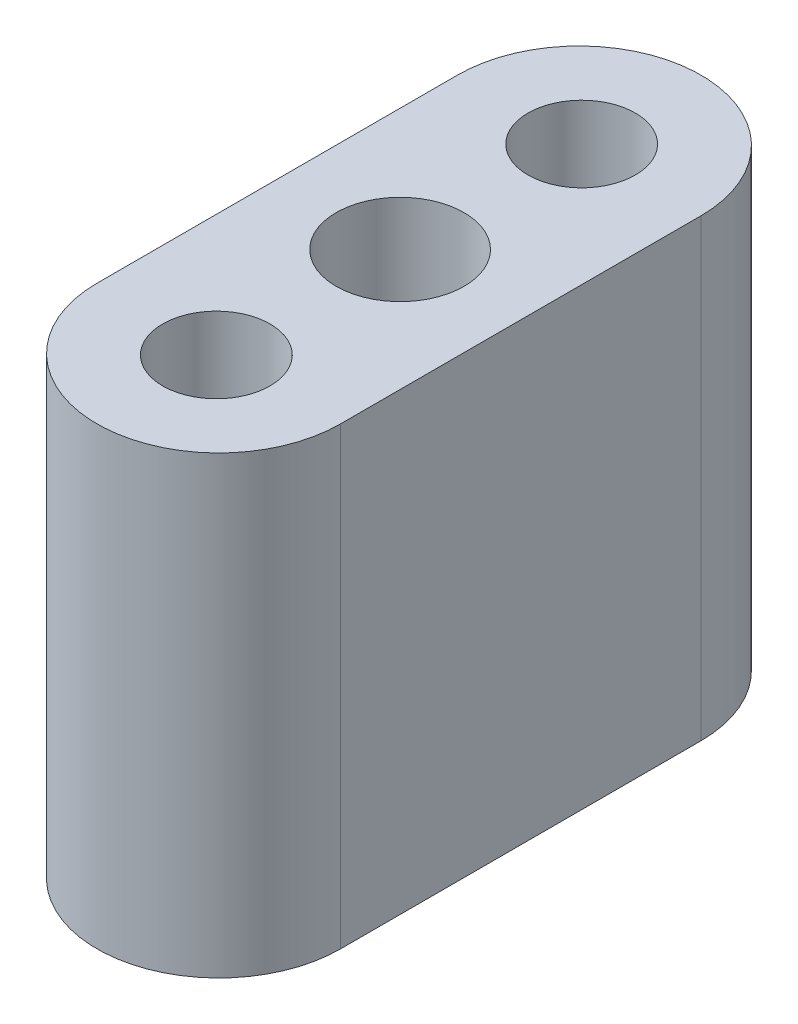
ISO-10303-21;
HEADER;
FILE_DESCRIPTION(('STEP AP214'),'2;1');
FILE_NAME('part.step','',(''),(''),'','','');
FILE_SCHEMA(('AUTOMOTIVE_DESIGN { 1 0 10303 214 1 1 1 1 }'));
ENDSEC;
DATA;
#1=APPLICATION_CONTEXT('core data for automotive mechanical design processes');
#2=APPLICATION_PROTOCOL_DEFINITION('international standard','automotive_design',2000,#1);
#3=PRODUCT_CONTEXT('',#1,'mechanical');
#4=PRODUCT('Part','Part','',(#3));
#5=PRODUCT_RELATED_PRODUCT_CATEGORY('part','',(#4));
#6=PRODUCT_DEFINITION_FORMATION('','',#4);
#7=PRODUCT_DEFINITION_CONTEXT('part definition',#1,'design');
#8=PRODUCT_DEFINITION('design','',#6,#7);
#9=PRODUCT_DEFINITION_SHAPE('','',#8);
#10=(LENGTH_UNIT() NAMED_UNIT(*) SI_UNIT(.MILLI.,.METRE.));
#11=(NAMED_UNIT(*) PLANE_ANGLE_UNIT() SI_UNIT($,.RADIAN.));
#12=(NAMED_UNIT(*) SI_UNIT($,.STERADIAN.) SOLID_ANGLE_UNIT());
#13=UNCERTAINTY_MEASURE_WITH_UNIT(LENGTH_MEASURE(1.E-05),#10,'distance_accuracy_value','');
#14=(GEOMETRIC_REPRESENTATION_CONTEXT(3) GLOBAL_UNCERTAINTY_ASSIGNED_CONTEXT((#13)) GLOBAL_UNIT_ASSIGNED_CONTEXT((#10,
#11,#12)) REPRESENTATION_CONTEXT('',''));
#15=CARTESIAN_POINT('',(0.,0.,0.));
#16=DIRECTION('',(0.,0.,1.));
#17=DIRECTION('',(1.,0.,0.));
#18=AXIS2_PLACEMENT_3D('',#15,#16,#17);
#19=CARTESIAN_POINT('',(0.,17.78,-7.0485));
#20=DIRECTION('',(0.,-1.,0.));
#21=DIRECTION('',(0.,0.,-1.));
#22=AXIS2_PLACEMENT_3D('',#19,#20,#21);
#23=CYLINDRICAL_SURFACE('',#22,4.7625);
#24=CARTESIAN_POINT('',(0.,0.,-7.0485));
#25=DIRECTION('',(0.,1.,0.));
#26=DIRECTION('',(0.,0.,1.));
#27=AXIS2_PLACEMENT_3D('',#24,#25,#26);
#28=CIRCLE('',#27,4.7625);
#29=CARTESIAN_POINT('',(4.7625,0.,-7.0485));
#30=VERTEX_POINT('',#29);
#31=CARTESIAN_POINT('',(-4.7625,0.,-7.0485));
#32=VERTEX_POINT('',#31);
#33=EDGE_CURVE('E121',#30,#32,#28,.T.);
#34=ORIENTED_EDGE('',*,*,#33,.T.);
#35=DIRECTION('',(0.,-1.,0.));
#36=VECTOR('',#35,1.);
#37=CARTESIAN_POINT('',(-4.7625,17.78,-7.0485));
#38=LINE('',#37,#36);
#39=CARTESIAN_POINT('',(-4.7625,17.78,-7.0485));
#40=VERTEX_POINT('',#39);
#41=EDGE_CURVE('E11',#40,#32,#38,.T.);
#42=ORIENTED_EDGE('',*,*,#41,.F.);
#43=CARTESIAN_POINT('',(0.,17.78,-7.0485));
#44=DIRECTION('',(0.,1.,0.));
#45=DIRECTION('',(0.,0.,1.));
#46=AXIS2_PLACEMENT_3D('',#43,#44,#45);
#47=CIRCLE('',#46,4.7625);
#48=CARTESIAN_POINT('',(4.7625,17.78,-7.0485));
#49=VERTEX_POINT('',#48);
#50=EDGE_CURVE('E122',#49,#40,#47,.T.);
#51=ORIENTED_EDGE('',*,*,#50,.F.);
#52=DIRECTION('',(0.,-1.,0.));
#53=VECTOR('',#52,1.);
#54=CARTESIAN_POINT('',(4.7625,17.78,-7.0485));
#55=LINE('',#54,#53);
#56=EDGE_CURVE('E128',#49,#30,#55,.T.);
#57=ORIENTED_EDGE('',*,*,#56,.T.);
#58=EDGE_LOOP('',(#34,#42,#51,#57));
#59=FACE_BOUND('',#58,.T.);
#60=ADVANCED_FACE('F37',(#59),#23,.T.);
#61=CARTESIAN_POINT('',(-4.7625,17.78,-7.0485));
#62=DIRECTION('',(1.,0.,0.));
#63=DIRECTION('',(0.,0.,-1.));
#64=AXIS2_PLACEMENT_3D('',#61,#62,#63);
#65=PLANE('',#64);
#66=DIRECTION('',(0.,0.,1.));
#67=VECTOR('',#66,1.);
#68=CARTESIAN_POINT('',(-4.7625,0.,-7.0485));
#69=LINE('',#68,#67);
#70=CARTESIAN_POINT('',(-4.7625,0.,7.0485));
#71=VERTEX_POINT('',#70);
#72=EDGE_CURVE('E131',#32,#71,#69,.T.);
#73=ORIENTED_EDGE('',*,*,#72,.T.);
#74=DIRECTION('',(0.,-1.,0.));
#75=VECTOR('',#74,1.);
#76=CARTESIAN_POINT('',(-4.7625,17.78,7.0485));
#77=LINE('',#76,#75);
#78=CARTESIAN_POINT('',(-4.7625,17.78,7.0485));
#79=VERTEX_POINT('',#78);
#80=EDGE_CURVE('E45',#79,#71,#77,.T.);
#81=ORIENTED_EDGE('',*,*,#80,.F.);
#82=DIRECTION('',(0.,0.,1.));
#83=VECTOR('',#82,1.);
#84=CARTESIAN_POINT('',(-4.7625,17.78,-7.0485));
#85=LINE('',#84,#83);
#86=EDGE_CURVE('E84',#40,#79,#85,.T.);
#87=ORIENTED_EDGE('',*,*,#86,.F.);
#88=ORIENTED_EDGE('',*,*,#41,.T.);
#89=EDGE_LOOP('',(#73,#81,#87,#88));
#90=FACE_BOUND('',#89,.T.);
#91=ADVANCED_FACE('F155',(#90),#65,.F.);
#92=CARTESIAN_POINT('',(0.,17.78,7.0485));
#93=DIRECTION('',(0.,-1.,0.));
#94=DIRECTION('',(0.,0.,-1.));
#95=AXIS2_PLACEMENT_3D('',#92,#93,#94);
#96=CYLINDRICAL_SURFACE('',#95,4.7625);
#97=CARTESIAN_POINT('',(0.,0.,7.0485));
#98=DIRECTION('',(0.,1.,0.));
#99=DIRECTION('',(0.,0.,1.));
#100=AXIS2_PLACEMENT_3D('',#97,#98,#99);
#101=CIRCLE('',#100,4.7625);
#102=CARTESIAN_POINT('',(4.7625,0.,7.0485));
#103=VERTEX_POINT('',#102);
#104=EDGE_CURVE('E71',#71,#103,#101,.T.);
#105=ORIENTED_EDGE('',*,*,#104,.T.);
#106=DIRECTION('',(0.,-1.,0.));
#107=VECTOR('',#106,1.);
#108=CARTESIAN_POINT('',(4.7625,17.78,7.0485));
#109=LINE('',#108,#107);
#110=CARTESIAN_POINT('',(4.7625,17.78,7.0485));
#111=VERTEX_POINT('',#110);
#112=EDGE_CURVE('E136',#111,#103,#109,.T.);
#113=ORIENTED_EDGE('',*,*,#112,.F.);
#114=CARTESIAN_POINT('',(0.,17.78,7.0485));
#115=DIRECTION('',(0.,1.,0.));
#116=DIRECTION('',(0.,0.,1.));
#117=AXIS2_PLACEMENT_3D('',#114,#115,#116);
#118=CIRCLE('',#117,4.7625);
#119=EDGE_CURVE('E125',#79,#111,#118,.T.);
#120=ORIENTED_EDGE('',*,*,#119,.F.);
#121=ORIENTED_EDGE('',*,*,#80,.T.);
#122=EDGE_LOOP('',(#105,#113,#120,#121));
#123=FACE_BOUND('',#122,.T.);
#124=ADVANCED_FACE('F138',(#123),#96,.T.);
#125=CARTESIAN_POINT('',(4.7625,17.78,7.0485));
#126=DIRECTION('',(-1.,0.,0.));
#127=DIRECTION('',(0.,0.,1.));
#128=AXIS2_PLACEMENT_3D('',#125,#126,#127);
#129=PLANE('',#128);
#130=DIRECTION('',(0.,0.,-1.));
#131=VECTOR('',#130,1.);
#132=CARTESIAN_POINT('',(4.7625,0.,7.0485));
#133=LINE('',#132,#131);
#134=EDGE_CURVE('E77',#103,#30,#133,.T.);
#135=ORIENTED_EDGE('',*,*,#134,.T.);
#136=ORIENTED_EDGE('',*,*,#56,.F.);
#137=DIRECTION('',(0.,0.,-1.));
#138=VECTOR('',#137,1.);
#139=CARTESIAN_POINT('',(4.7625,17.78,7.0485));
#140=LINE('',#139,#138);
#141=EDGE_CURVE('E53',#111,#49,#140,.T.);
#142=ORIENTED_EDGE('',*,*,#141,.F.);
#143=ORIENTED_EDGE('',*,*,#112,.T.);
#144=EDGE_LOOP('',(#135,#136,#142,#143));
#145=FACE_BOUND('',#144,.T.);
#146=ADVANCED_FACE('F145',(#145),#129,.F.);
#147=CARTESIAN_POINT('',(0.,17.78,-7.0485));
#148=DIRECTION('',(0.,1.,0.));
#149=DIRECTION('',(0.,0.,1.));
#150=AXIS2_PLACEMENT_3D('',#147,#148,#149);
#151=PLANE('',#150);
#152=CARTESIAN_POINT('',(0.,17.78,-7.14248));
#153=DIRECTION('',(0.,1.,0.));
#154=DIRECTION('',(0.,0.,1.));
#155=AXIS2_PLACEMENT_3D('',#152,#153,#154);
#156=CIRCLE('',#155,2.09999999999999);
#157=CARTESIAN_POINT('',(0.,17.78,-5.04248000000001));
#158=VERTEX_POINT('',#157);
#159=EDGE_CURVE('E105',#158,#158,#156,.T.);
#160=ORIENTED_EDGE('',*,*,#159,.F.);
#161=EDGE_LOOP('',(#160));
#162=FACE_BOUND('',#161,.T.);
#163=CARTESIAN_POINT('',(0.,17.78,7.14248));
#164=DIRECTION('',(0.,1.,0.));
#165=DIRECTION('',(0.,0.,1.));
#166=AXIS2_PLACEMENT_3D('',#163,#164,#165);
#167=CIRCLE('',#166,2.09999999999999);
#168=CARTESIAN_POINT('',(0.,17.78,9.24247999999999));
#169=VERTEX_POINT('',#168);
#170=EDGE_CURVE('E104',#169,#169,#167,.T.);
#171=ORIENTED_EDGE('',*,*,#170,.F.);
#172=EDGE_LOOP('',(#171));
#173=FACE_BOUND('',#172,.T.);
#174=CARTESIAN_POINT('',(0.021671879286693,17.78,-0.0216718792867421));
#175=DIRECTION('',(0.,1.,0.));
#176=DIRECTION('',(0.,0.,1.));
#177=AXIS2_PLACEMENT_3D('',#174,#175,#176);
#178=CIRCLE('',#177,2.5);
#179=CARTESIAN_POINT('',(0.021671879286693,17.78,2.47832812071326));
#180=VERTEX_POINT('',#179);
#181=EDGE_CURVE('E118',#180,#180,#178,.T.);
#182=ORIENTED_EDGE('',*,*,#181,.F.);
#183=EDGE_LOOP('',(#182));
#184=FACE_BOUND('',#183,.T.);
#185=ORIENTED_EDGE('',*,*,#50,.T.);
#186=ORIENTED_EDGE('',*,*,#86,.T.);
#187=ORIENTED_EDGE('',*,*,#119,.T.);
#188=ORIENTED_EDGE('',*,*,#141,.T.);
#189=EDGE_LOOP('',(#185,#186,#187,#188));
#190=FACE_BOUND('',#189,.T.);
#191=ADVANCED_FACE('F147',(#162,#173,#184,#190),#151,.T.);
#192=CARTESIAN_POINT('',(0.,0.,-7.0485));
#193=DIRECTION('',(0.,1.,0.));
#194=DIRECTION('',(0.,0.,1.));
#195=AXIS2_PLACEMENT_3D('',#192,#193,#194);
#196=PLANE('',#195);
#197=ORIENTED_EDGE('',*,*,#33,.F.);
#198=ORIENTED_EDGE('',*,*,#134,.F.);
#199=ORIENTED_EDGE('',*,*,#104,.F.);
#200=ORIENTED_EDGE('',*,*,#72,.F.);
#201=EDGE_LOOP('',(#197,#198,#199,#200));
#202=FACE_BOUND('',#201,.T.);
#203=ADVANCED_FACE('F141',(#202),#196,.F.);
#204=CARTESIAN_POINT('',(0.021671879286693,17.78,-0.0216718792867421));
#205=DIRECTION('',(0.,1.,0.));
#206=DIRECTION('',(0.,0.,1.));
#207=AXIS2_PLACEMENT_3D('',#204,#205,#206);
#208=CYLINDRICAL_SURFACE('',#207,2.5);
#209=CARTESIAN_POINT('',(0.021671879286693,11.7856,-0.0216718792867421));
#210=DIRECTION('',(0.,1.,0.));
#211=DIRECTION('',(0.,0.,1.));
#212=AXIS2_PLACEMENT_3D('',#209,#210,#211);
#213=CIRCLE('',#212,2.5);
#214=CARTESIAN_POINT('',(0.021671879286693,11.7856,2.47832812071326));
#215=VERTEX_POINT('',#214);
#216=EDGE_CURVE('E115',#215,#215,#213,.T.);
#217=ORIENTED_EDGE('',*,*,#216,.F.);
#218=EDGE_LOOP('',(#217));
#219=FACE_BOUND('',#218,.T.);
#220=ORIENTED_EDGE('',*,*,#181,.T.);
#221=EDGE_LOOP('',(#220));
#222=FACE_BOUND('',#221,.T.);
#223=ADVANCED_FACE('F182',(#219,#222),#208,.F.);
#224=CARTESIAN_POINT('',(0.021671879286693,11.7856,-0.0216718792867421));
#225=DIRECTION('',(0.,1.,0.));
#226=DIRECTION('',(0.,0.,1.));
#227=AXIS2_PLACEMENT_3D('',#224,#225,#226);
#228=CONICAL_SURFACE('',#227,2.5,1.02974425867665);
#229=CARTESIAN_POINT('',(0.0216718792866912,10.2834484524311,-0.0216718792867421));
#230=VERTEX_POINT('',#229);
#231=VERTEX_LOOP('',#230);
#232=FACE_BOUND('',#231,.T.);
#233=ORIENTED_EDGE('',*,*,#216,.T.);
#234=EDGE_LOOP('',(#233));
#235=FACE_BOUND('',#234,.T.);
#236=ADVANCED_FACE('F190',(#232,#235),#228,.F.);
#237=CARTESIAN_POINT('',(0.,3.78459999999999,7.14248));
#238=DIRECTION('',(0.,1.,0.));
#239=DIRECTION('',(0.,0.,1.));
#240=AXIS2_PLACEMENT_3D('',#237,#238,#239);
#241=CONICAL_SURFACE('',#240,2.09999999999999,1.02974425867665);
#242=CARTESIAN_POINT('',(0.,2.52279270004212,7.14248));
#243=VERTEX_POINT('',#242);
#244=VERTEX_LOOP('',#243);
#245=FACE_BOUND('',#244,.T.);
#246=CARTESIAN_POINT('',(0.,3.78459999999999,7.14248));
#247=DIRECTION('',(0.,1.,0.));
#248=DIRECTION('',(0.,0.,1.));
#249=AXIS2_PLACEMENT_3D('',#246,#247,#248);
#250=CIRCLE('',#249,2.09999999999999);
#251=CARTESIAN_POINT('',(0.,3.78459999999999,9.24247999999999));
#252=VERTEX_POINT('',#251);
#253=EDGE_CURVE('E108',#252,#252,#250,.T.);
#254=ORIENTED_EDGE('',*,*,#253,.T.);
#255=EDGE_LOOP('',(#254));
#256=FACE_BOUND('',#255,.T.);
#257=ADVANCED_FACE('F200',(#245,#256),#241,.F.);
#258=CARTESIAN_POINT('',(0.,17.78,7.14248));
#259=DIRECTION('',(0.,1.,0.));
#260=DIRECTION('',(0.,0.,1.));
#261=AXIS2_PLACEMENT_3D('',#258,#259,#260);
#262=CYLINDRICAL_SURFACE('',#261,2.09999999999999);
#263=ORIENTED_EDGE('',*,*,#253,.F.);
#264=EDGE_LOOP('',(#263));
#265=FACE_BOUND('',#264,.T.);
#266=ORIENTED_EDGE('',*,*,#170,.T.);
#267=EDGE_LOOP('',(#266));
#268=FACE_BOUND('',#267,.T.);
#269=ADVANCED_FACE('F98',(#265,#268),#262,.F.);
#270=CARTESIAN_POINT('',(0.,3.78459999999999,-7.14248));
#271=DIRECTION('',(0.,1.,0.));
#272=DIRECTION('',(0.,0.,1.));
#273=AXIS2_PLACEMENT_3D('',#270,#271,#272);
#274=CONICAL_SURFACE('',#273,2.09999999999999,1.02974425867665);
#275=CARTESIAN_POINT('',(0.,2.52279270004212,-7.14248));
#276=VERTEX_POINT('',#275);
#277=VERTEX_LOOP('',#276);
#278=FACE_BOUND('',#277,.T.);
#279=CARTESIAN_POINT('',(0.,3.78459999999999,-7.14248));
#280=DIRECTION('',(0.,1.,0.));
#281=DIRECTION('',(0.,0.,1.));
#282=AXIS2_PLACEMENT_3D('',#279,#280,#281);
#283=CIRCLE('',#282,2.09999999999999);
#284=CARTESIAN_POINT('',(0.,3.78459999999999,-5.04248000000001));
#285=VERTEX_POINT('',#284);
#286=EDGE_CURVE('E102',#285,#285,#283,.T.);
#287=ORIENTED_EDGE('',*,*,#286,.T.);
#288=EDGE_LOOP('',(#287));
#289=FACE_BOUND('',#288,.T.);
#290=ADVANCED_FACE('F94',(#278,#289),#274,.F.);
#291=CARTESIAN_POINT('',(0.,17.78,-7.14248));
#292=DIRECTION('',(0.,1.,0.));
#293=DIRECTION('',(0.,0.,1.));
#294=AXIS2_PLACEMENT_3D('',#291,#292,#293);
#295=CYLINDRICAL_SURFACE('',#294,2.09999999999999);
#296=ORIENTED_EDGE('',*,*,#286,.F.);
#297=EDGE_LOOP('',(#296));
#298=FACE_BOUND('',#297,.T.);
#299=ORIENTED_EDGE('',*,*,#159,.T.);
#300=EDGE_LOOP('',(#299));
#301=FACE_BOUND('',#300,.T.);
#302=ADVANCED_FACE('F97',(#298,#301),#295,.F.);
#303=CLOSED_SHELL('',(#60,#91,#124,#146,#191,#203,#223,#236,#257,#269,#290,#302));
#304=MANIFOLD_SOLID_BREP('B2',#303);
#305=ADVANCED_BREP_SHAPE_REPRESENTATION('',(#18,#304),#14);
#306=SHAPE_DEFINITION_REPRESENTATION(#9,#305);
ENDSEC;
END-ISO-10303-21;
